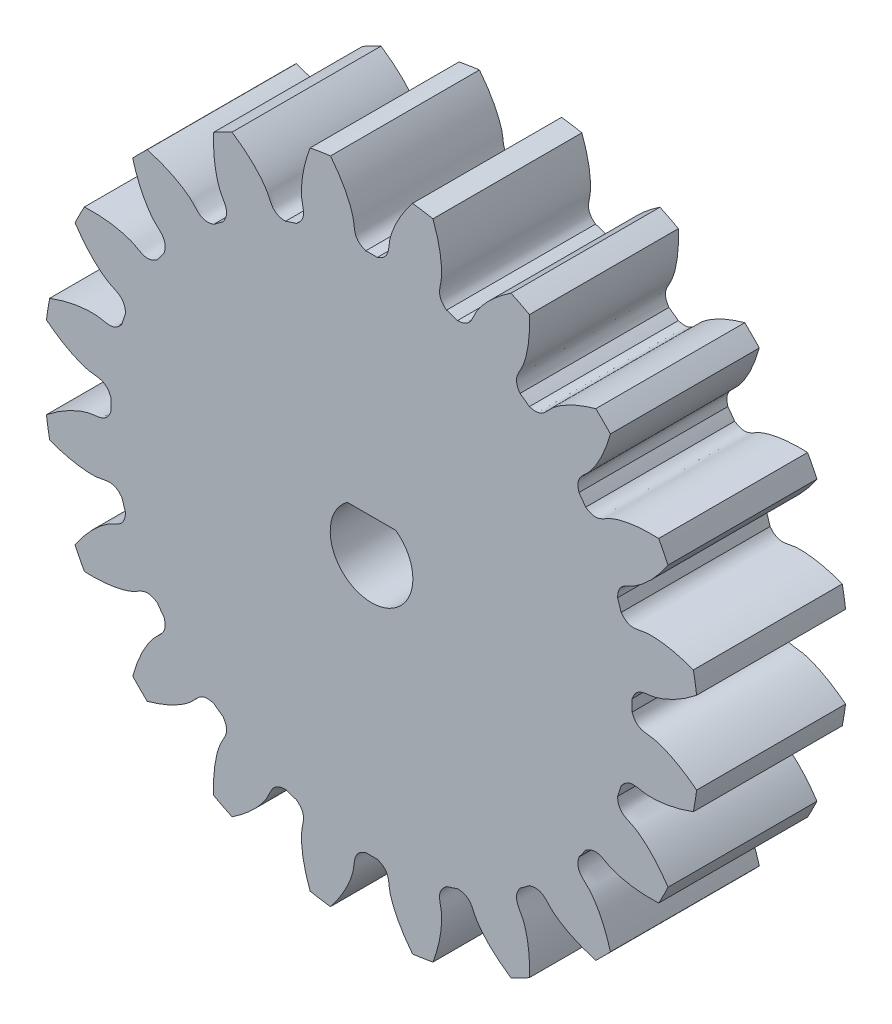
from build123d import *

# Parameters (mm, degrees)
SKETCH_1_R               = 22
EXTRUDE_1_DEPTH          = 10
CUT_EXTRUDE_1_DEPTH      = 33.680269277
PATTERN_CIRCULAR_1_COUNT = 20
CUT_EXTRUDE_2_DEPTH      = 10


with BuildPart() as part:
    # Sketch 1 → Extrude 1 (new body)
    with BuildSketch(Plane.XY):
        Circle(SKETCH_1_R)
    extrude(amount=EXTRUDE_1_DEPTH)

    # Sketch 2 → Cut-Extrude 1 (cut, through all)
    with BuildSketch(Plane.XY):
        with BuildLine():
            ThreePointArc((0.386633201, 17.495728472), (0, 17.5), (-0.386633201, 17.495728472))
            add(Edge.make_bspline(
                [(-0.386633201, 17.495728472), (-1.22237881, 17.786951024), (-1.114168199, 18.374227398), (-1.225794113, 18.940018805), (-1.237784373, 18.995113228), (-1.25262178, 19.05726923), (-1.270584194, 19.126393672), (-1.29195828, 19.202382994), (-1.31702411, 19.285125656), (-1.346059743, 19.374501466), (-1.3793395, 19.470381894), (-1.4171342, 19.57263009), (-1.459710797, 19.681101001), (-1.507332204, 19.795641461), (-1.560257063, 19.916090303), (-1.618739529, 20.042278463), (-1.683029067, 20.174029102), (-1.753370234, 20.311157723), (-1.830002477, 20.4534723), (-1.913159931, 20.600773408), (-2.003071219, 20.752854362), (-2.099959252, 20.909501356), (-2.204041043, 21.070493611), (-2.315527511, 21.235603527), (-2.434623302, 21.404596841), (-2.561526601, 21.577232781), (-2.696428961, 21.753264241), (-2.839515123, 21.932437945), (-2.990962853, 22.114494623), (-3.15094277, 22.299169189), (-3.319618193, 22.486190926), (-3.497144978, 22.67528367), (-3.683671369, 22.866166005), (-3.879337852, 23.058551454), (-4.084277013, 23.252148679), (-4.298613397, 23.446661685), (-4.522463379, 23.641790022), (-4.755935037, 23.837228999), (-4.999128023, 24.032669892), (-5.252133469, 24.227800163), (-5.515033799, 24.42230368), (-5.882947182, 24.683279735), (-6.167864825, 24.872665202), (-6.362315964, 24.996503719)],
                knots=[0, 0, 0, 0, 0.165916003, 0.170905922, 0.176663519, 0.183188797, 0.190481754, 0.198542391, 0.207370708, 0.216966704, 0.22733038, 0.238461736, 0.250360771, 0.263027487, 0.276461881, 0.290663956, 0.30563371, 0.321371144, 0.337876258, 0.355149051, 0.373189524, 0.391997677, 0.411573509, 0.431917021, 0.453028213, 0.474907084, 0.497553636, 0.520967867, 0.545149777, 0.570099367, 0.595816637, 0.622301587, 0.649554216, 0.677574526, 0.706362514, 0.735918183, 0.766241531, 0.797332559, 0.829191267, 0.861817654, 0.895211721, 0.929373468, 1, 1, 1, 1], degree=3))
            ThreePointArc((-6.362315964, 24.996503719), (0, 25.793492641), (6.362315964, 24.996503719))
            add(Edge.make_bspline(
                [(0.386633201, 17.495728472), (1.22237881, 17.786951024), (1.114168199, 18.374227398), (1.225794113, 18.940018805), (1.237784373, 18.995113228), (1.25262178, 19.05726923), (1.270584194, 19.126393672), (1.29195828, 19.202382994), (1.31702411, 19.285125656), (1.346059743, 19.374501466), (1.3793395, 19.470381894), (1.4171342, 19.57263009), (1.459710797, 19.681101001), (1.507332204, 19.795641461), (1.560257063, 19.916090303), (1.618739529, 20.042278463), (1.683029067, 20.174029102), (1.753370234, 20.311157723), (1.830002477, 20.4534723), (1.913159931, 20.600773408), (2.003071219, 20.752854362), (2.099959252, 20.909501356), (2.204041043, 21.070493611), (2.315527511, 21.235603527), (2.434623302, 21.404596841), (2.561526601, 21.577232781), (2.696428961, 21.753264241), (2.839515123, 21.932437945), (2.990962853, 22.114494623), (3.15094277, 22.299169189), (3.319618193, 22.486190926), (3.497144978, 22.67528367), (3.683671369, 22.866166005), (3.879337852, 23.058551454), (4.084277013, 23.252148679), (4.298613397, 23.446661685), (4.522463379, 23.641790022), (4.755935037, 23.837228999), (4.999128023, 24.032669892), (5.252133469, 24.227800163), (5.515033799, 24.42230368), (5.882947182, 24.683279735), (6.167864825, 24.872665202), (6.362315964, 24.996503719)],
                knots=[0, 0, 0, 0, 0.165916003, 0.170905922, 0.176663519, 0.183188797, 0.190481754, 0.198542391, 0.207370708, 0.216966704, 0.22733038, 0.238461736, 0.250360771, 0.263027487, 0.276461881, 0.290663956, 0.30563371, 0.321371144, 0.337876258, 0.355149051, 0.373189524, 0.391997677, 0.411573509, 0.431917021, 0.453028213, 0.474907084, 0.497553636, 0.520967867, 0.545149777, 0.570099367, 0.595816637, 0.622301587, 0.649554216, 0.677574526, 0.706362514, 0.735918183, 0.766241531, 0.797332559, 0.829191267, 0.861817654, 0.895211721, 0.929373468, 1, 1, 1, 1], degree=3))
        make_face()
    cut_extrude_1 = extrude(amount=CUT_EXTRUDE_1_DEPTH, mode=Mode.SUBTRACT)

    # Pattern Circular 1: Cut-Extrude 1 ×20 about axis
    pattern_circular_1_axis = Axis((0, 0, 10), (0, 0, -1))
    for i in range(1, PATTERN_CIRCULAR_1_COUNT):
        add(cut_extrude_1.rotate(pattern_circular_1_axis, i * 360 / PATTERN_CIRCULAR_1_COUNT), mode=Mode.SUBTRACT)

    # Sketch 4 → Cut-Extrude 2 (cut)
    with BuildSketch(Plane(origin=(0, 0, 0), x_dir=(-1, 0, 0), z_dir=(0, 0, -1))):
        with BuildLine():
            Line((-1.624230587, 2.25), (1.624230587, 2.25))
            ThreePointArc((1.624230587, 2.25), (0, -2.775), (-1.624230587, 2.25))
        make_face()
    extrude(amount=-CUT_EXTRUDE_2_DEPTH, mode=Mode.SUBTRACT)


solid = part.part
